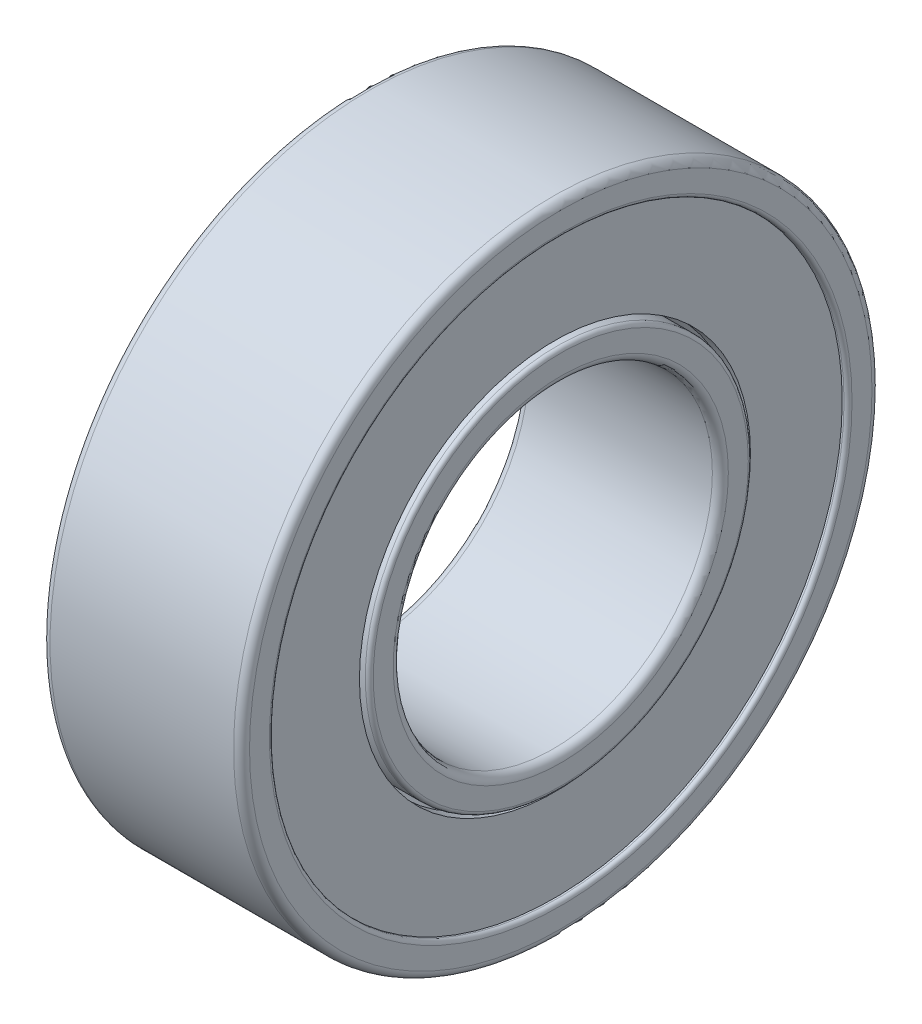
ISO-10303-21;
HEADER;
FILE_DESCRIPTION(('STEP AP214'),'2;1');
FILE_NAME('part.step','',(''),(''),'','','');
FILE_SCHEMA(('AUTOMOTIVE_DESIGN { 1 0 10303 214 1 1 1 1 }'));
ENDSEC;
DATA;
#1=APPLICATION_CONTEXT('core data for automotive mechanical design processes');
#2=APPLICATION_PROTOCOL_DEFINITION('international standard','automotive_design',2000,#1);
#3=PRODUCT_CONTEXT('',#1,'mechanical');
#4=PRODUCT('Part','Part','',(#3));
#5=PRODUCT_RELATED_PRODUCT_CATEGORY('part','',(#4));
#6=PRODUCT_DEFINITION_FORMATION('','',#4);
#7=PRODUCT_DEFINITION_CONTEXT('part definition',#1,'design');
#8=PRODUCT_DEFINITION('design','',#6,#7);
#9=PRODUCT_DEFINITION_SHAPE('','',#8);
#10=(LENGTH_UNIT() NAMED_UNIT(*) SI_UNIT(.MILLI.,.METRE.));
#11=(NAMED_UNIT(*) PLANE_ANGLE_UNIT() SI_UNIT($,.RADIAN.));
#12=(NAMED_UNIT(*) SI_UNIT($,.STERADIAN.) SOLID_ANGLE_UNIT());
#13=UNCERTAINTY_MEASURE_WITH_UNIT(LENGTH_MEASURE(1.E-05),#10,'distance_accuracy_value','');
#14=(GEOMETRIC_REPRESENTATION_CONTEXT(3) GLOBAL_UNCERTAINTY_ASSIGNED_CONTEXT((#13)) GLOBAL_UNIT_ASSIGNED_CONTEXT((#10,
#11,#12)) REPRESENTATION_CONTEXT('',''));
#15=CARTESIAN_POINT('',(0.,0.,0.));
#16=DIRECTION('',(0.,0.,1.));
#17=DIRECTION('',(1.,0.,0.));
#18=AXIS2_PLACEMENT_3D('',#15,#16,#17);
#19=CARTESIAN_POINT('',(-2.35424103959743,7.2,0.));
#20=DIRECTION('',(-1.,0.,0.));
#21=DIRECTION('',(0.,0.,1.));
#22=AXIS2_PLACEMENT_3D('',#19,#20,#21);
#23=PLANE('',#22);
#24=CARTESIAN_POINT('',(-2.35424103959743,0.,0.));
#25=DIRECTION('',(1.,0.,0.));
#26=DIRECTION('',(0.,0.,-1.));
#27=AXIS2_PLACEMENT_3D('',#24,#25,#26);
#28=CIRCLE('',#27,4.9);
#29=CARTESIAN_POINT('',(-2.35424103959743,0.,-4.9));
#30=VERTEX_POINT('',#29);
#31=EDGE_CURVE('E10',#30,#30,#28,.T.);
#32=ORIENTED_EDGE('',*,*,#31,.T.);
#33=EDGE_LOOP('',(#32));
#34=FACE_BOUND('',#33,.T.);
#35=CARTESIAN_POINT('',(-2.35424103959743,0.,0.));
#36=DIRECTION('',(1.,0.,0.));
#37=DIRECTION('',(0.,0.,-1.));
#38=AXIS2_PLACEMENT_3D('',#35,#36,#37);
#39=CIRCLE('',#38,7.2);
#40=CARTESIAN_POINT('',(-2.35424103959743,0.,-7.2));
#41=VERTEX_POINT('',#40);
#42=EDGE_CURVE('E122',#41,#41,#39,.T.);
#43=ORIENTED_EDGE('',*,*,#42,.F.);
#44=EDGE_LOOP('',(#43));
#45=FACE_BOUND('',#44,.T.);
#46=ADVANCED_FACE('F34',(#34,#45),#23,.T.);
#47=CARTESIAN_POINT('',(0.,0.,0.));
#48=DIRECTION('',(1.,0.,0.));
#49=DIRECTION('',(0.,0.,-1.));
#50=AXIS2_PLACEMENT_3D('',#47,#48,#49);
#51=CYLINDRICAL_SURFACE('',#50,4.9);
#52=CARTESIAN_POINT('',(-2.04309639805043,0.,0.));
#53=DIRECTION('',(1.,0.,0.));
#54=DIRECTION('',(0.,0.,-1.));
#55=AXIS2_PLACEMENT_3D('',#52,#53,#54);
#56=CIRCLE('',#55,4.9);
#57=CARTESIAN_POINT('',(-2.04309639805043,0.,-4.9));
#58=VERTEX_POINT('',#57);
#59=EDGE_CURVE('E40',#58,#58,#56,.T.);
#60=ORIENTED_EDGE('',*,*,#59,.T.);
#61=EDGE_LOOP('',(#60));
#62=FACE_BOUND('',#61,.T.);
#63=ORIENTED_EDGE('',*,*,#31,.F.);
#64=EDGE_LOOP('',(#63));
#65=FACE_BOUND('',#64,.T.);
#66=ADVANCED_FACE('F130',(#62,#65),#51,.F.);
#67=CARTESIAN_POINT('',(-2.04309639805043,4.9,0.));
#68=DIRECTION('',(1.,0.,0.));
#69=DIRECTION('',(0.,0.,-1.));
#70=AXIS2_PLACEMENT_3D('',#67,#68,#69);
#71=PLANE('',#70);
#72=CARTESIAN_POINT('',(-2.04309639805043,0.,0.));
#73=DIRECTION('',(1.,0.,0.));
#74=DIRECTION('',(0.,0.,-1.));
#75=AXIS2_PLACEMENT_3D('',#72,#73,#74);
#76=CIRCLE('',#75,7.2);
#77=CARTESIAN_POINT('',(-2.04309639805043,0.,-7.2));
#78=VERTEX_POINT('',#77);
#79=EDGE_CURVE('E44',#78,#78,#76,.T.);
#80=ORIENTED_EDGE('',*,*,#79,.T.);
#81=EDGE_LOOP('',(#80));
#82=FACE_BOUND('',#81,.T.);
#83=ORIENTED_EDGE('',*,*,#59,.F.);
#84=EDGE_LOOP('',(#83));
#85=FACE_BOUND('',#84,.T.);
#86=ADVANCED_FACE('F134',(#82,#85),#71,.T.);
#87=CARTESIAN_POINT('',(0.,0.,0.));
#88=DIRECTION('',(1.,0.,0.));
#89=DIRECTION('',(0.,0.,-1.));
#90=AXIS2_PLACEMENT_3D('',#87,#88,#89);
#91=CYLINDRICAL_SURFACE('',#90,7.2);
#92=CARTESIAN_POINT('',(-1.30381984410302,0.,0.));
#93=DIRECTION('',(1.,0.,0.));
#94=DIRECTION('',(0.,0.,-1.));
#95=AXIS2_PLACEMENT_3D('',#92,#93,#94);
#96=CIRCLE('',#95,7.2);
#97=CARTESIAN_POINT('',(-1.30381984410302,0.,-7.2));
#98=VERTEX_POINT('',#97);
#99=EDGE_CURVE('E48',#98,#98,#96,.T.);
#100=ORIENTED_EDGE('',*,*,#99,.T.);
#101=EDGE_LOOP('',(#100));
#102=FACE_BOUND('',#101,.T.);
#103=ORIENTED_EDGE('',*,*,#79,.F.);
#104=EDGE_LOOP('',(#103));
#105=FACE_BOUND('',#104,.T.);
#106=ADVANCED_FACE('F138',(#102,#105),#91,.F.);
#107=CARTESIAN_POINT('',(0.,0.,0.));
#108=DIRECTION('',(1.,0.,0.));
#109=DIRECTION('',(0.,0.,-1.));
#110=AXIS2_PLACEMENT_3D('',#107,#108,#109);
#111=TOROIDAL_SURFACE('',#110,6.05,1.73851838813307);
#112=CARTESIAN_POINT('',(-1.20828232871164,0.,0.));
#113=DIRECTION('',(1.,0.,0.));
#114=DIRECTION('',(0.,0.,-1.));
#115=AXIS2_PLACEMENT_3D('',#112,#113,#114);
#116=CIRCLE('',#115,4.8);
#117=CARTESIAN_POINT('',(-1.20828232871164,0.,-4.8));
#118=VERTEX_POINT('',#117);
#119=EDGE_CURVE('E53',#118,#118,#116,.T.);
#120=ORIENTED_EDGE('',*,*,#119,.T.);
#121=EDGE_LOOP('',(#120));
#122=FACE_BOUND('',#121,.T.);
#123=ORIENTED_EDGE('',*,*,#99,.F.);
#124=EDGE_LOOP('',(#123));
#125=FACE_BOUND('',#124,.T.);
#126=ADVANCED_FACE('F145',(#122,#125),#111,.T.);
#127=CARTESIAN_POINT('',(0.,0.,0.));
#128=DIRECTION('',(1.,0.,0.));
#129=DIRECTION('',(0.,0.,-1.));
#130=AXIS2_PLACEMENT_3D('',#127,#128,#129);
#131=CYLINDRICAL_SURFACE('',#130,4.8);
#132=CARTESIAN_POINT('',(-2.4,0.,0.));
#133=DIRECTION('',(1.,0.,0.));
#134=DIRECTION('',(0.,0.,-1.));
#135=AXIS2_PLACEMENT_3D('',#132,#133,#134);
#136=CIRCLE('',#135,4.8);
#137=CARTESIAN_POINT('',(-2.4,0.,-4.8));
#138=VERTEX_POINT('',#137);
#139=EDGE_CURVE('E56',#138,#138,#136,.T.);
#140=ORIENTED_EDGE('',*,*,#139,.T.);
#141=EDGE_LOOP('',(#140));
#142=FACE_BOUND('',#141,.T.);
#143=ORIENTED_EDGE('',*,*,#119,.F.);
#144=EDGE_LOOP('',(#143));
#145=FACE_BOUND('',#144,.T.);
#146=ADVANCED_FACE('F149',(#142,#145),#131,.T.);
#147=CARTESIAN_POINT('',(-2.4,0.,0.));
#148=DIRECTION('',(1.,0.,0.));
#149=DIRECTION('',(0.,0.,-1.));
#150=AXIS2_PLACEMENT_3D('',#147,#148,#149);
#151=TOROIDAL_SURFACE('',#150,4.7,0.0999999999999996);
#152=CARTESIAN_POINT('',(-2.5,0.,0.));
#153=DIRECTION('',(1.,0.,0.));
#154=DIRECTION('',(0.,0.,-1.));
#155=AXIS2_PLACEMENT_3D('',#152,#153,#154);
#156=CIRCLE('',#155,4.7);
#157=CARTESIAN_POINT('',(-2.5,0.,-4.7));
#158=VERTEX_POINT('',#157);
#159=EDGE_CURVE('E59',#158,#158,#156,.T.);
#160=ORIENTED_EDGE('',*,*,#159,.T.);
#161=EDGE_LOOP('',(#160));
#162=FACE_BOUND('',#161,.T.);
#163=ORIENTED_EDGE('',*,*,#139,.F.);
#164=EDGE_LOOP('',(#163));
#165=FACE_BOUND('',#164,.T.);
#166=ADVANCED_FACE('F153',(#162,#165),#151,.T.);
#167=CARTESIAN_POINT('',(-2.5,4.7,0.));
#168=DIRECTION('',(-1.,0.,0.));
#169=DIRECTION('',(0.,0.,1.));
#170=AXIS2_PLACEMENT_3D('',#167,#168,#169);
#171=PLANE('',#170);
#172=CARTESIAN_POINT('',(-2.5,0.,0.));
#173=DIRECTION('',(1.,0.,0.));
#174=DIRECTION('',(0.,0.,-1.));
#175=AXIS2_PLACEMENT_3D('',#172,#173,#174);
#176=CIRCLE('',#175,4.2);
#177=CARTESIAN_POINT('',(-2.5,0.,-4.2));
#178=VERTEX_POINT('',#177);
#179=EDGE_CURVE('E62',#178,#178,#176,.T.);
#180=ORIENTED_EDGE('',*,*,#179,.T.);
#181=EDGE_LOOP('',(#180));
#182=FACE_BOUND('',#181,.T.);
#183=ORIENTED_EDGE('',*,*,#159,.F.);
#184=EDGE_LOOP('',(#183));
#185=FACE_BOUND('',#184,.T.);
#186=ADVANCED_FACE('F157',(#182,#185),#171,.T.);
#187=CARTESIAN_POINT('',(-2.3,0.,0.));
#188=DIRECTION('',(1.,0.,0.));
#189=DIRECTION('',(0.,0.,-1.));
#190=AXIS2_PLACEMENT_3D('',#187,#188,#189);
#191=TOROIDAL_SURFACE('',#190,4.2,0.2);
#192=CARTESIAN_POINT('',(-2.3,0.,0.));
#193=DIRECTION('',(1.,0.,0.));
#194=DIRECTION('',(0.,0.,-1.));
#195=AXIS2_PLACEMENT_3D('',#192,#193,#194);
#196=CIRCLE('',#195,4.);
#197=CARTESIAN_POINT('',(-2.3,0.,-4.));
#198=VERTEX_POINT('',#197);
#199=EDGE_CURVE('E65',#198,#198,#196,.T.);
#200=ORIENTED_EDGE('',*,*,#199,.T.);
#201=EDGE_LOOP('',(#200));
#202=FACE_BOUND('',#201,.T.);
#203=ORIENTED_EDGE('',*,*,#179,.F.);
#204=EDGE_LOOP('',(#203));
#205=FACE_BOUND('',#204,.T.);
#206=ADVANCED_FACE('F161',(#202,#205),#191,.T.);
#207=CARTESIAN_POINT('',(0.,0.,0.));
#208=DIRECTION('',(1.,0.,0.));
#209=DIRECTION('',(0.,0.,-1.));
#210=AXIS2_PLACEMENT_3D('',#207,#208,#209);
#211=CYLINDRICAL_SURFACE('',#210,4.);
#212=CARTESIAN_POINT('',(2.3,0.,0.));
#213=DIRECTION('',(1.,0.,0.));
#214=DIRECTION('',(0.,0.,-1.));
#215=AXIS2_PLACEMENT_3D('',#212,#213,#214);
#216=CIRCLE('',#215,4.);
#217=CARTESIAN_POINT('',(2.3,0.,-4.));
#218=VERTEX_POINT('',#217);
#219=EDGE_CURVE('E68',#218,#218,#216,.T.);
#220=ORIENTED_EDGE('',*,*,#219,.T.);
#221=EDGE_LOOP('',(#220));
#222=FACE_BOUND('',#221,.T.);
#223=ORIENTED_EDGE('',*,*,#199,.F.);
#224=EDGE_LOOP('',(#223));
#225=FACE_BOUND('',#224,.T.);
#226=ADVANCED_FACE('F165',(#222,#225),#211,.F.);
#227=CARTESIAN_POINT('',(2.3,0.,0.));
#228=DIRECTION('',(1.,0.,0.));
#229=DIRECTION('',(0.,0.,-1.));
#230=AXIS2_PLACEMENT_3D('',#227,#228,#229);
#231=TOROIDAL_SURFACE('',#230,4.2,0.2);
#232=CARTESIAN_POINT('',(2.5,0.,0.));
#233=DIRECTION('',(1.,0.,0.));
#234=DIRECTION('',(0.,0.,-1.));
#235=AXIS2_PLACEMENT_3D('',#232,#233,#234);
#236=CIRCLE('',#235,4.2);
#237=CARTESIAN_POINT('',(2.5,0.,-4.2));
#238=VERTEX_POINT('',#237);
#239=EDGE_CURVE('E71',#238,#238,#236,.T.);
#240=ORIENTED_EDGE('',*,*,#239,.T.);
#241=EDGE_LOOP('',(#240));
#242=FACE_BOUND('',#241,.T.);
#243=ORIENTED_EDGE('',*,*,#219,.F.);
#244=EDGE_LOOP('',(#243));
#245=FACE_BOUND('',#244,.T.);
#246=ADVANCED_FACE('F169',(#242,#245),#231,.T.);
#247=CARTESIAN_POINT('',(2.5,4.7,0.));
#248=DIRECTION('',(1.,0.,0.));
#249=DIRECTION('',(0.,0.,-1.));
#250=AXIS2_PLACEMENT_3D('',#247,#248,#249);
#251=PLANE('',#250);
#252=CARTESIAN_POINT('',(2.5,0.,0.));
#253=DIRECTION('',(1.,0.,0.));
#254=DIRECTION('',(0.,0.,-1.));
#255=AXIS2_PLACEMENT_3D('',#252,#253,#254);
#256=CIRCLE('',#255,4.7);
#257=CARTESIAN_POINT('',(2.5,0.,-4.7));
#258=VERTEX_POINT('',#257);
#259=EDGE_CURVE('E74',#258,#258,#256,.T.);
#260=ORIENTED_EDGE('',*,*,#259,.T.);
#261=EDGE_LOOP('',(#260));
#262=FACE_BOUND('',#261,.T.);
#263=ORIENTED_EDGE('',*,*,#239,.F.);
#264=EDGE_LOOP('',(#263));
#265=FACE_BOUND('',#264,.T.);
#266=ADVANCED_FACE('F173',(#262,#265),#251,.T.);
#267=CARTESIAN_POINT('',(2.4,0.,0.));
#268=DIRECTION('',(1.,0.,0.));
#269=DIRECTION('',(0.,0.,-1.));
#270=AXIS2_PLACEMENT_3D('',#267,#268,#269);
#271=TOROIDAL_SURFACE('',#270,4.7,0.0999999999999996);
#272=CARTESIAN_POINT('',(2.4,0.,0.));
#273=DIRECTION('',(1.,0.,0.));
#274=DIRECTION('',(0.,0.,-1.));
#275=AXIS2_PLACEMENT_3D('',#272,#273,#274);
#276=CIRCLE('',#275,4.8);
#277=CARTESIAN_POINT('',(2.4,0.,-4.8));
#278=VERTEX_POINT('',#277);
#279=EDGE_CURVE('E77',#278,#278,#276,.T.);
#280=ORIENTED_EDGE('',*,*,#279,.T.);
#281=EDGE_LOOP('',(#280));
#282=FACE_BOUND('',#281,.T.);
#283=ORIENTED_EDGE('',*,*,#259,.F.);
#284=EDGE_LOOP('',(#283));
#285=FACE_BOUND('',#284,.T.);
#286=ADVANCED_FACE('F177',(#282,#285),#271,.T.);
#287=CARTESIAN_POINT('',(0.,0.,0.));
#288=DIRECTION('',(1.,0.,0.));
#289=DIRECTION('',(0.,0.,-1.));
#290=AXIS2_PLACEMENT_3D('',#287,#288,#289);
#291=CYLINDRICAL_SURFACE('',#290,4.8);
#292=CARTESIAN_POINT('',(1.20828232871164,0.,0.));
#293=DIRECTION('',(1.,0.,0.));
#294=DIRECTION('',(0.,0.,-1.));
#295=AXIS2_PLACEMENT_3D('',#292,#293,#294);
#296=CIRCLE('',#295,4.8);
#297=CARTESIAN_POINT('',(1.20828232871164,0.,-4.8));
#298=VERTEX_POINT('',#297);
#299=EDGE_CURVE('E80',#298,#298,#296,.T.);
#300=ORIENTED_EDGE('',*,*,#299,.T.);
#301=EDGE_LOOP('',(#300));
#302=FACE_BOUND('',#301,.T.);
#303=ORIENTED_EDGE('',*,*,#279,.F.);
#304=EDGE_LOOP('',(#303));
#305=FACE_BOUND('',#304,.T.);
#306=ADVANCED_FACE('F181',(#302,#305),#291,.T.);
#307=CARTESIAN_POINT('',(0.,0.,0.));
#308=DIRECTION('',(1.,0.,0.));
#309=DIRECTION('',(0.,0.,-1.));
#310=AXIS2_PLACEMENT_3D('',#307,#308,#309);
#311=TOROIDAL_SURFACE('',#310,6.05,1.73851838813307);
#312=CARTESIAN_POINT('',(1.30381984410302,0.,0.));
#313=DIRECTION('',(1.,0.,0.));
#314=DIRECTION('',(0.,0.,-1.));
#315=AXIS2_PLACEMENT_3D('',#312,#313,#314);
#316=CIRCLE('',#315,7.2);
#317=CARTESIAN_POINT('',(1.30381984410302,0.,-7.2));
#318=VERTEX_POINT('',#317);
#319=EDGE_CURVE('E83',#318,#318,#316,.T.);
#320=ORIENTED_EDGE('',*,*,#319,.T.);
#321=EDGE_LOOP('',(#320));
#322=FACE_BOUND('',#321,.T.);
#323=ORIENTED_EDGE('',*,*,#299,.F.);
#324=EDGE_LOOP('',(#323));
#325=FACE_BOUND('',#324,.T.);
#326=ADVANCED_FACE('F185',(#322,#325),#311,.T.);
#327=CARTESIAN_POINT('',(0.,0.,0.));
#328=DIRECTION('',(1.,0.,0.));
#329=DIRECTION('',(0.,0.,-1.));
#330=AXIS2_PLACEMENT_3D('',#327,#328,#329);
#331=CYLINDRICAL_SURFACE('',#330,7.2);
#332=CARTESIAN_POINT('',(2.04309639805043,0.,0.));
#333=DIRECTION('',(1.,0.,0.));
#334=DIRECTION('',(0.,0.,-1.));
#335=AXIS2_PLACEMENT_3D('',#332,#333,#334);
#336=CIRCLE('',#335,7.2);
#337=CARTESIAN_POINT('',(2.04309639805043,0.,-7.2));
#338=VERTEX_POINT('',#337);
#339=EDGE_CURVE('E86',#338,#338,#336,.T.);
#340=ORIENTED_EDGE('',*,*,#339,.T.);
#341=EDGE_LOOP('',(#340));
#342=FACE_BOUND('',#341,.T.);
#343=ORIENTED_EDGE('',*,*,#319,.F.);
#344=EDGE_LOOP('',(#343));
#345=FACE_BOUND('',#344,.T.);
#346=ADVANCED_FACE('F189',(#342,#345),#331,.F.);
#347=CARTESIAN_POINT('',(2.04309639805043,4.9,0.));
#348=DIRECTION('',(-1.,0.,0.));
#349=DIRECTION('',(0.,0.,1.));
#350=AXIS2_PLACEMENT_3D('',#347,#348,#349);
#351=PLANE('',#350);
#352=CARTESIAN_POINT('',(2.04309639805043,0.,0.));
#353=DIRECTION('',(1.,0.,0.));
#354=DIRECTION('',(0.,0.,-1.));
#355=AXIS2_PLACEMENT_3D('',#352,#353,#354);
#356=CIRCLE('',#355,4.9);
#357=CARTESIAN_POINT('',(2.04309639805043,0.,-4.9));
#358=VERTEX_POINT('',#357);
#359=EDGE_CURVE('E89',#358,#358,#356,.T.);
#360=ORIENTED_EDGE('',*,*,#359,.T.);
#361=EDGE_LOOP('',(#360));
#362=FACE_BOUND('',#361,.T.);
#363=ORIENTED_EDGE('',*,*,#339,.F.);
#364=EDGE_LOOP('',(#363));
#365=FACE_BOUND('',#364,.T.);
#366=ADVANCED_FACE('F193',(#362,#365),#351,.T.);
#367=CARTESIAN_POINT('',(0.,0.,0.));
#368=DIRECTION('',(1.,0.,0.));
#369=DIRECTION('',(0.,0.,-1.));
#370=AXIS2_PLACEMENT_3D('',#367,#368,#369);
#371=CYLINDRICAL_SURFACE('',#370,4.9);
#372=CARTESIAN_POINT('',(2.35424103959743,0.,0.));
#373=DIRECTION('',(1.,0.,0.));
#374=DIRECTION('',(0.,0.,-1.));
#375=AXIS2_PLACEMENT_3D('',#372,#373,#374);
#376=CIRCLE('',#375,4.9);
#377=CARTESIAN_POINT('',(2.35424103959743,0.,-4.9));
#378=VERTEX_POINT('',#377);
#379=EDGE_CURVE('E92',#378,#378,#376,.T.);
#380=ORIENTED_EDGE('',*,*,#379,.T.);
#381=EDGE_LOOP('',(#380));
#382=FACE_BOUND('',#381,.T.);
#383=ORIENTED_EDGE('',*,*,#359,.F.);
#384=EDGE_LOOP('',(#383));
#385=FACE_BOUND('',#384,.T.);
#386=ADVANCED_FACE('F197',(#382,#385),#371,.F.);
#387=CARTESIAN_POINT('',(2.35424103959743,7.2,0.));
#388=DIRECTION('',(1.,0.,0.));
#389=DIRECTION('',(0.,0.,-1.));
#390=AXIS2_PLACEMENT_3D('',#387,#388,#389);
#391=PLANE('',#390);
#392=CARTESIAN_POINT('',(2.35424103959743,0.,0.));
#393=DIRECTION('',(1.,0.,0.));
#394=DIRECTION('',(0.,0.,-1.));
#395=AXIS2_PLACEMENT_3D('',#392,#393,#394);
#396=CIRCLE('',#395,7.2);
#397=CARTESIAN_POINT('',(2.35424103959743,0.,-7.2));
#398=VERTEX_POINT('',#397);
#399=EDGE_CURVE('E95',#398,#398,#396,.T.);
#400=ORIENTED_EDGE('',*,*,#399,.T.);
#401=EDGE_LOOP('',(#400));
#402=FACE_BOUND('',#401,.T.);
#403=ORIENTED_EDGE('',*,*,#379,.F.);
#404=EDGE_LOOP('',(#403));
#405=FACE_BOUND('',#404,.T.);
#406=ADVANCED_FACE('F201',(#402,#405),#391,.T.);
#407=CARTESIAN_POINT('',(0.,0.,0.));
#408=DIRECTION('',(1.,0.,0.));
#409=DIRECTION('',(0.,0.,-1.));
#410=AXIS2_PLACEMENT_3D('',#407,#408,#409);
#411=CYLINDRICAL_SURFACE('',#410,7.2);
#412=CARTESIAN_POINT('',(2.4,0.,0.));
#413=DIRECTION('',(1.,0.,0.));
#414=DIRECTION('',(0.,0.,-1.));
#415=AXIS2_PLACEMENT_3D('',#412,#413,#414);
#416=CIRCLE('',#415,7.2);
#417=CARTESIAN_POINT('',(2.4,0.,-7.2));
#418=VERTEX_POINT('',#417);
#419=EDGE_CURVE('E98',#418,#418,#416,.T.);
#420=ORIENTED_EDGE('',*,*,#419,.T.);
#421=EDGE_LOOP('',(#420));
#422=FACE_BOUND('',#421,.T.);
#423=ORIENTED_EDGE('',*,*,#399,.F.);
#424=EDGE_LOOP('',(#423));
#425=FACE_BOUND('',#424,.T.);
#426=ADVANCED_FACE('F205',(#422,#425),#411,.F.);
#427=CARTESIAN_POINT('',(2.4,0.,0.));
#428=DIRECTION('',(1.,0.,0.));
#429=DIRECTION('',(0.,0.,-1.));
#430=AXIS2_PLACEMENT_3D('',#427,#428,#429);
#431=TOROIDAL_SURFACE('',#430,7.3,0.100000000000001);
#432=CARTESIAN_POINT('',(2.5,0.,0.));
#433=DIRECTION('',(1.,0.,0.));
#434=DIRECTION('',(0.,0.,-1.));
#435=AXIS2_PLACEMENT_3D('',#432,#433,#434);
#436=CIRCLE('',#435,7.3);
#437=CARTESIAN_POINT('',(2.5,0.,-7.3));
#438=VERTEX_POINT('',#437);
#439=EDGE_CURVE('E101',#438,#438,#436,.T.);
#440=ORIENTED_EDGE('',*,*,#439,.T.);
#441=EDGE_LOOP('',(#440));
#442=FACE_BOUND('',#441,.T.);
#443=ORIENTED_EDGE('',*,*,#419,.F.);
#444=EDGE_LOOP('',(#443));
#445=FACE_BOUND('',#444,.T.);
#446=ADVANCED_FACE('F209',(#442,#445),#431,.T.);
#447=CARTESIAN_POINT('',(2.5,7.8,0.));
#448=DIRECTION('',(1.,0.,0.));
#449=DIRECTION('',(0.,0.,-1.));
#450=AXIS2_PLACEMENT_3D('',#447,#448,#449);
#451=PLANE('',#450);
#452=CARTESIAN_POINT('',(2.5,0.,0.));
#453=DIRECTION('',(1.,0.,0.));
#454=DIRECTION('',(0.,0.,-1.));
#455=AXIS2_PLACEMENT_3D('',#452,#453,#454);
#456=CIRCLE('',#455,7.8);
#457=CARTESIAN_POINT('',(2.5,0.,-7.8));
#458=VERTEX_POINT('',#457);
#459=EDGE_CURVE('E104',#458,#458,#456,.T.);
#460=ORIENTED_EDGE('',*,*,#459,.T.);
#461=EDGE_LOOP('',(#460));
#462=FACE_BOUND('',#461,.T.);
#463=ORIENTED_EDGE('',*,*,#439,.F.);
#464=EDGE_LOOP('',(#463));
#465=FACE_BOUND('',#464,.T.);
#466=ADVANCED_FACE('F213',(#462,#465),#451,.T.);
#467=CARTESIAN_POINT('',(2.3,0.,0.));
#468=DIRECTION('',(1.,0.,0.));
#469=DIRECTION('',(0.,0.,-1.));
#470=AXIS2_PLACEMENT_3D('',#467,#468,#469);
#471=TOROIDAL_SURFACE('',#470,7.8,0.200000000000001);
#472=CARTESIAN_POINT('',(2.3,0.,0.));
#473=DIRECTION('',(1.,0.,0.));
#474=DIRECTION('',(0.,0.,-1.));
#475=AXIS2_PLACEMENT_3D('',#472,#473,#474);
#476=CIRCLE('',#475,8.);
#477=CARTESIAN_POINT('',(2.3,0.,-8.));
#478=VERTEX_POINT('',#477);
#479=EDGE_CURVE('E107',#478,#478,#476,.T.);
#480=ORIENTED_EDGE('',*,*,#479,.T.);
#481=EDGE_LOOP('',(#480));
#482=FACE_BOUND('',#481,.T.);
#483=ORIENTED_EDGE('',*,*,#459,.F.);
#484=EDGE_LOOP('',(#483));
#485=FACE_BOUND('',#484,.T.);
#486=ADVANCED_FACE('F217',(#482,#485),#471,.T.);
#487=CARTESIAN_POINT('',(0.,0.,0.));
#488=DIRECTION('',(1.,0.,0.));
#489=DIRECTION('',(0.,0.,-1.));
#490=AXIS2_PLACEMENT_3D('',#487,#488,#489);
#491=CYLINDRICAL_SURFACE('',#490,8.);
#492=CARTESIAN_POINT('',(-2.3,0.,0.));
#493=DIRECTION('',(1.,0.,0.));
#494=DIRECTION('',(0.,0.,-1.));
#495=AXIS2_PLACEMENT_3D('',#492,#493,#494);
#496=CIRCLE('',#495,8.);
#497=CARTESIAN_POINT('',(-2.3,0.,-8.));
#498=VERTEX_POINT('',#497);
#499=EDGE_CURVE('E110',#498,#498,#496,.T.);
#500=ORIENTED_EDGE('',*,*,#499,.T.);
#501=EDGE_LOOP('',(#500));
#502=FACE_BOUND('',#501,.T.);
#503=ORIENTED_EDGE('',*,*,#479,.F.);
#504=EDGE_LOOP('',(#503));
#505=FACE_BOUND('',#504,.T.);
#506=ADVANCED_FACE('F221',(#502,#505),#491,.T.);
#507=CARTESIAN_POINT('',(-2.3,0.,0.));
#508=DIRECTION('',(1.,0.,0.));
#509=DIRECTION('',(0.,0.,-1.));
#510=AXIS2_PLACEMENT_3D('',#507,#508,#509);
#511=TOROIDAL_SURFACE('',#510,7.8,0.200000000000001);
#512=CARTESIAN_POINT('',(-2.5,0.,0.));
#513=DIRECTION('',(1.,0.,0.));
#514=DIRECTION('',(0.,0.,-1.));
#515=AXIS2_PLACEMENT_3D('',#512,#513,#514);
#516=CIRCLE('',#515,7.8);
#517=CARTESIAN_POINT('',(-2.5,0.,-7.8));
#518=VERTEX_POINT('',#517);
#519=EDGE_CURVE('E113',#518,#518,#516,.T.);
#520=ORIENTED_EDGE('',*,*,#519,.T.);
#521=EDGE_LOOP('',(#520));
#522=FACE_BOUND('',#521,.T.);
#523=ORIENTED_EDGE('',*,*,#499,.F.);
#524=EDGE_LOOP('',(#523));
#525=FACE_BOUND('',#524,.T.);
#526=ADVANCED_FACE('F225',(#522,#525),#511,.T.);
#527=CARTESIAN_POINT('',(-2.5,7.8,0.));
#528=DIRECTION('',(-1.,0.,0.));
#529=DIRECTION('',(0.,0.,1.));
#530=AXIS2_PLACEMENT_3D('',#527,#528,#529);
#531=PLANE('',#530);
#532=CARTESIAN_POINT('',(-2.5,0.,0.));
#533=DIRECTION('',(1.,0.,0.));
#534=DIRECTION('',(0.,0.,-1.));
#535=AXIS2_PLACEMENT_3D('',#532,#533,#534);
#536=CIRCLE('',#535,7.3);
#537=CARTESIAN_POINT('',(-2.5,0.,-7.3));
#538=VERTEX_POINT('',#537);
#539=EDGE_CURVE('E116',#538,#538,#536,.T.);
#540=ORIENTED_EDGE('',*,*,#539,.T.);
#541=EDGE_LOOP('',(#540));
#542=FACE_BOUND('',#541,.T.);
#543=ORIENTED_EDGE('',*,*,#519,.F.);
#544=EDGE_LOOP('',(#543));
#545=FACE_BOUND('',#544,.T.);
#546=ADVANCED_FACE('F229',(#542,#545),#531,.T.);
#547=CARTESIAN_POINT('',(-2.4,0.,0.));
#548=DIRECTION('',(1.,0.,0.));
#549=DIRECTION('',(0.,0.,-1.));
#550=AXIS2_PLACEMENT_3D('',#547,#548,#549);
#551=TOROIDAL_SURFACE('',#550,7.3,0.100000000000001);
#552=CARTESIAN_POINT('',(-2.4,0.,0.));
#553=DIRECTION('',(1.,0.,0.));
#554=DIRECTION('',(0.,0.,-1.));
#555=AXIS2_PLACEMENT_3D('',#552,#553,#554);
#556=CIRCLE('',#555,7.2);
#557=CARTESIAN_POINT('',(-2.4,0.,-7.2));
#558=VERTEX_POINT('',#557);
#559=EDGE_CURVE('E119',#558,#558,#556,.T.);
#560=ORIENTED_EDGE('',*,*,#559,.T.);
#561=EDGE_LOOP('',(#560));
#562=FACE_BOUND('',#561,.T.);
#563=ORIENTED_EDGE('',*,*,#539,.F.);
#564=EDGE_LOOP('',(#563));
#565=FACE_BOUND('',#564,.T.);
#566=ADVANCED_FACE('F233',(#562,#565),#551,.T.);
#567=CARTESIAN_POINT('',(0.,0.,0.));
#568=DIRECTION('',(1.,0.,0.));
#569=DIRECTION('',(0.,0.,-1.));
#570=AXIS2_PLACEMENT_3D('',#567,#568,#569);
#571=CYLINDRICAL_SURFACE('',#570,7.2);
#572=ORIENTED_EDGE('',*,*,#42,.T.);
#573=EDGE_LOOP('',(#572));
#574=FACE_BOUND('',#573,.T.);
#575=ORIENTED_EDGE('',*,*,#559,.F.);
#576=EDGE_LOOP('',(#575));
#577=FACE_BOUND('',#576,.T.);
#578=ADVANCED_FACE('F126',(#574,#577),#571,.F.);
#579=CLOSED_SHELL('',(#46,#66,#86,#106,#126,#146,#166,#186,#206,#226,#246,#266,#286,#306,#326,
#346,#366,#386,#406,#426,#446,#466,#486,#506,#526,#546,#566,#578));
#580=MANIFOLD_SOLID_BREP('B2',#579);
#581=ADVANCED_BREP_SHAPE_REPRESENTATION('',(#18,#580),#14);
#582=SHAPE_DEFINITION_REPRESENTATION(#9,#581);
ENDSEC;
END-ISO-10303-21;
